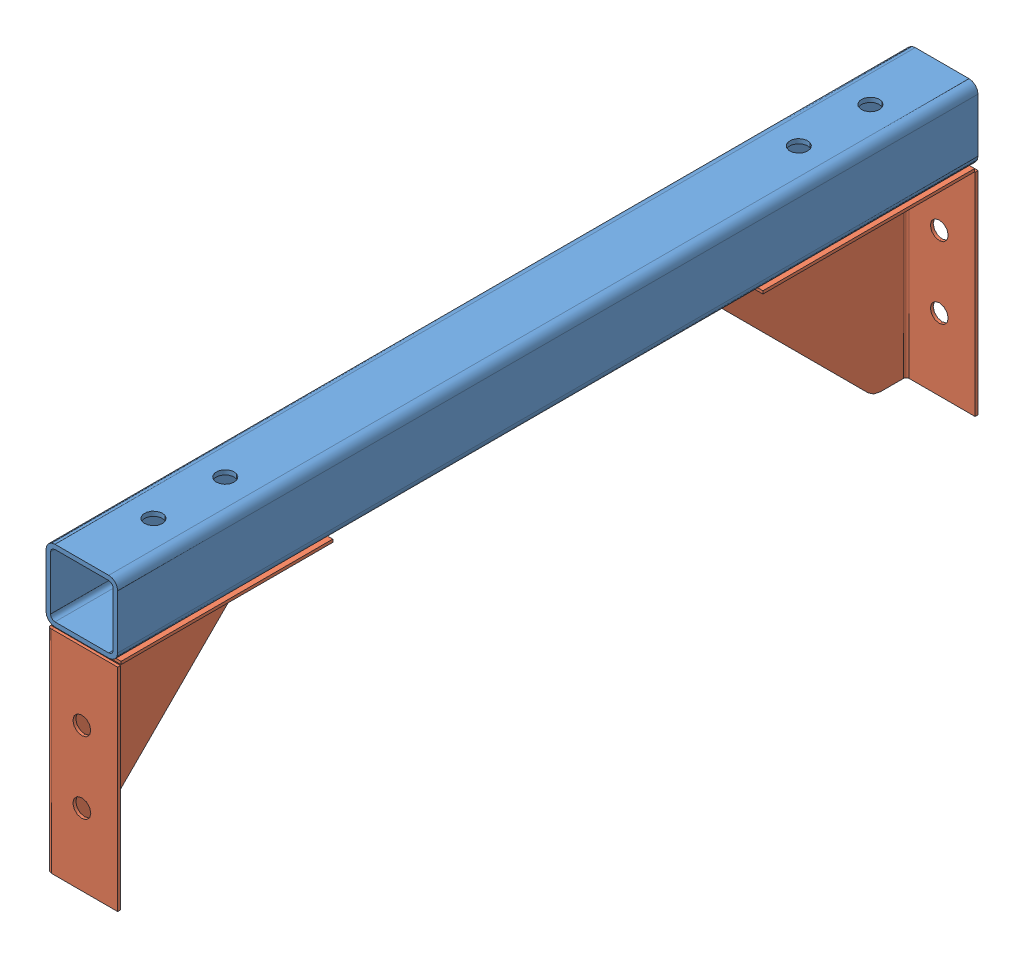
SolidWorks assembly Lower_Brace_&.SLDASM, configuration Default (file format 15000). Lengths in mm.
Overall size (25.4 101.6 304.8).
3 component instances, 2 part files, 2 mates.
Components (placement in the parent):
- Brace_Cross_Bar_&-1: Brace_Cross_Bar_&.SLDPRT [Plain] at (0 -27.3812 0) size (25.4 25.4 304.8)
- Brace_Corner_&-1: Brace_Corner_&.SLDPRT [Default] at (-12.7 -40.0812 152.4) x (0 0 -1) z (1 0 0) size (76.2 76.2 25.4)
- Brace_Corner_&-2: Brace_Corner_&.SLDPRT [Default] at (-12.7 -40.0812 -152.4) x (0 -1 0) z (1 0 0) size (76.2 76.2 25.4)
Mates (geometry in assembly coordinates):
- Coincident1: coincident anti-aligned: plane of Brace_Cross_Bar_&-1 through (12.7 -40.0812 152.4) normal (0 -1 0); plane of Brace_Corner_&-1 through (12.7 -40.0812 76.2) normal (0 1 0)
- Coincident2: coincident anti-aligned: plane of Brace_Cross_Bar_&-1 through (12.7 -40.0812 152.4) normal (0 -1 0); plane of Brace_Corner_&-2 through (12.7 -40.0812 -533.4) normal (0 1 0)
